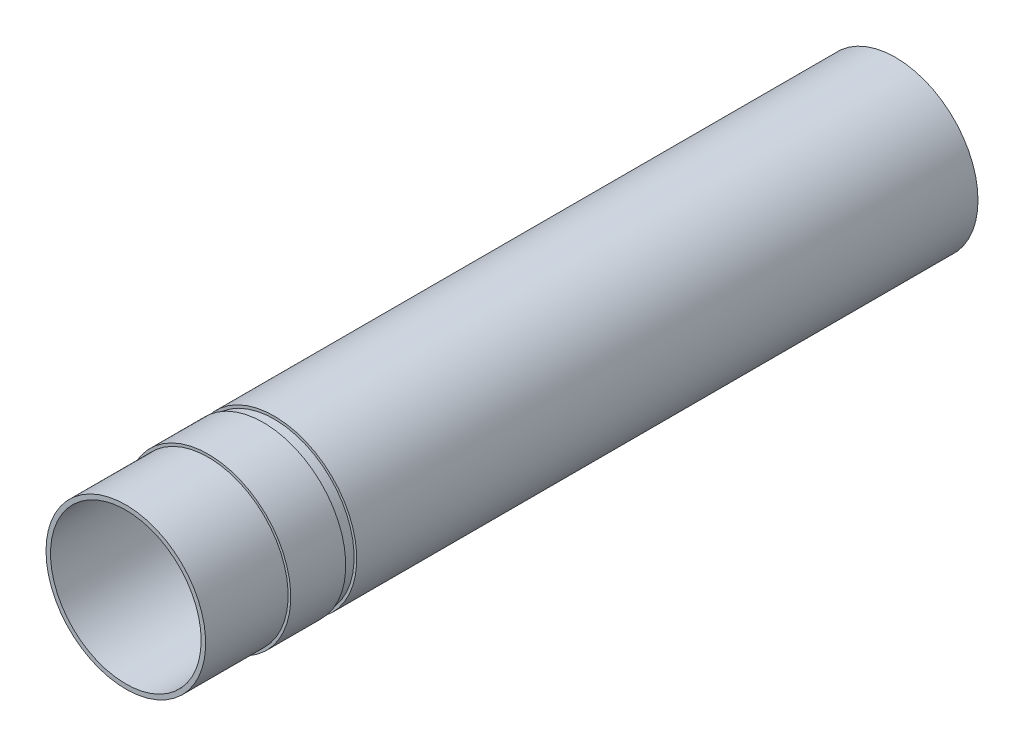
ISO-10303-21;
HEADER;
FILE_DESCRIPTION(('STEP AP214'),'2;1');
FILE_NAME('part.step','',(''),(''),'','','');
FILE_SCHEMA(('AUTOMOTIVE_DESIGN { 1 0 10303 214 1 1 1 1 }'));
ENDSEC;
DATA;
#1=APPLICATION_CONTEXT('core data for automotive mechanical design processes');
#2=APPLICATION_PROTOCOL_DEFINITION('international standard','automotive_design',2000,#1);
#3=PRODUCT_CONTEXT('',#1,'mechanical');
#4=PRODUCT('Part','Part','',(#3));
#5=PRODUCT_RELATED_PRODUCT_CATEGORY('part','',(#4));
#6=PRODUCT_DEFINITION_FORMATION('','',#4);
#7=PRODUCT_DEFINITION_CONTEXT('part definition',#1,'design');
#8=PRODUCT_DEFINITION('design','',#6,#7);
#9=PRODUCT_DEFINITION_SHAPE('','',#8);
#10=(LENGTH_UNIT() NAMED_UNIT(*) SI_UNIT(.MILLI.,.METRE.));
#11=(NAMED_UNIT(*) PLANE_ANGLE_UNIT() SI_UNIT($,.RADIAN.));
#12=(NAMED_UNIT(*) SI_UNIT($,.STERADIAN.) SOLID_ANGLE_UNIT());
#13=UNCERTAINTY_MEASURE_WITH_UNIT(LENGTH_MEASURE(1.E-05),#10,'distance_accuracy_value','');
#14=(GEOMETRIC_REPRESENTATION_CONTEXT(3) GLOBAL_UNCERTAINTY_ASSIGNED_CONTEXT((#13)) GLOBAL_UNIT_ASSIGNED_CONTEXT((#10,
#11,#12)) REPRESENTATION_CONTEXT('',''));
#15=CARTESIAN_POINT('',(0.,0.,0.));
#16=DIRECTION('',(0.,0.,1.));
#17=DIRECTION('',(1.,0.,0.));
#18=AXIS2_PLACEMENT_3D('',#15,#16,#17);
#19=CARTESIAN_POINT('',(0.,0.,88.9));
#20=DIRECTION('',(0.,0.,-1.));
#21=DIRECTION('',(-1.,0.,0.));
#22=AXIS2_PLACEMENT_3D('',#19,#20,#21);
#23=CYLINDRICAL_SURFACE('',#22,19.05);
#24=CARTESIAN_POINT('',(0.,0.,54.61));
#25=DIRECTION('',(0.,0.,-1.));
#26=DIRECTION('',(-1.,0.,0.));
#27=AXIS2_PLACEMENT_3D('',#24,#25,#26);
#28=CIRCLE('',#27,19.05);
#29=CARTESIAN_POINT('',(-19.05,0.,54.61));
#30=VERTEX_POINT('',#29);
#31=EDGE_CURVE('E112',#30,#30,#28,.T.);
#32=ORIENTED_EDGE('',*,*,#31,.T.);
#33=EDGE_LOOP('',(#32));
#34=FACE_BOUND('',#33,.T.);
#35=CARTESIAN_POINT('',(0.,0.,-88.9));
#36=DIRECTION('',(0.,0.,1.));
#37=DIRECTION('',(1.,0.,0.));
#38=AXIS2_PLACEMENT_3D('',#35,#36,#37);
#39=CIRCLE('',#38,19.05);
#40=CARTESIAN_POINT('',(19.05,0.,-88.9));
#41=VERTEX_POINT('',#40);
#42=EDGE_CURVE('E40',#41,#41,#39,.T.);
#43=ORIENTED_EDGE('',*,*,#42,.T.);
#44=EDGE_LOOP('',(#43));
#45=FACE_BOUND('',#44,.T.);
#46=ADVANCED_FACE('F32',(#34,#45),#23,.T.);
#47=CARTESIAN_POINT('',(0.,0.,88.9));
#48=DIRECTION('',(0.,0.,-1.));
#49=DIRECTION('',(-1.,0.,0.));
#50=AXIS2_PLACEMENT_3D('',#47,#48,#49);
#51=CYLINDRICAL_SURFACE('',#50,17.399);
#52=CARTESIAN_POINT('',(0.,0.,-50.8));
#53=DIRECTION('',(0.,0.,-1.));
#54=DIRECTION('',(-1.,0.,0.));
#55=AXIS2_PLACEMENT_3D('',#52,#53,#54);
#56=CIRCLE('',#55,17.399);
#57=CARTESIAN_POINT('',(-17.399,0.,-50.8));
#58=VERTEX_POINT('',#57);
#59=EDGE_CURVE('E48',#58,#58,#56,.T.);
#60=ORIENTED_EDGE('',*,*,#59,.F.);
#61=EDGE_LOOP('',(#60));
#62=FACE_BOUND('',#61,.T.);
#63=CARTESIAN_POINT('',(0.,0.,-88.9));
#64=DIRECTION('',(0.,0.,1.));
#65=DIRECTION('',(1.,0.,0.));
#66=AXIS2_PLACEMENT_3D('',#63,#64,#65);
#67=CIRCLE('',#66,17.399);
#68=CARTESIAN_POINT('',(17.399,0.,-88.9));
#69=VERTEX_POINT('',#68);
#70=EDGE_CURVE('E45',#69,#69,#67,.T.);
#71=ORIENTED_EDGE('',*,*,#70,.F.);
#72=EDGE_LOOP('',(#71));
#73=FACE_BOUND('',#72,.T.);
#74=ADVANCED_FACE('F69',(#62,#73),#51,.F.);
#75=CARTESIAN_POINT('',(0.,0.,-88.9));
#76=DIRECTION('',(0.,0.,1.));
#77=DIRECTION('',(1.,0.,0.));
#78=AXIS2_PLACEMENT_3D('',#75,#76,#77);
#79=PLANE('',#78);
#80=ORIENTED_EDGE('',*,*,#70,.T.);
#81=EDGE_LOOP('',(#80));
#82=FACE_BOUND('',#81,.T.);
#83=ORIENTED_EDGE('',*,*,#42,.F.);
#84=EDGE_LOOP('',(#83));
#85=FACE_BOUND('',#84,.T.);
#86=ADVANCED_FACE('F66',(#82,#85),#79,.F.);
#87=CARTESIAN_POINT('',(0.,0.,-48.26));
#88=DIRECTION('',(0.,0.,1.));
#89=DIRECTION('',(1.,0.,0.));
#90=AXIS2_PLACEMENT_3D('',#87,#88,#89);
#91=PLANE('',#90);
#92=CARTESIAN_POINT('',(0.,0.,-48.26));
#93=DIRECTION('',(0.,0.,1.));
#94=DIRECTION('',(1.,0.,0.));
#95=AXIS2_PLACEMENT_3D('',#92,#93,#94);
#96=CIRCLE('',#95,17.399);
#97=CARTESIAN_POINT('',(17.399,0.,-48.26));
#98=VERTEX_POINT('',#97);
#99=EDGE_CURVE('E36',#98,#98,#96,.T.);
#100=ORIENTED_EDGE('',*,*,#99,.T.);
#101=EDGE_LOOP('',(#100));
#102=FACE_BOUND('',#101,.T.);
#103=CARTESIAN_POINT('',(0.,0.,-48.26));
#104=DIRECTION('',(0.,0.,-1.));
#105=DIRECTION('',(-1.,0.,0.));
#106=AXIS2_PLACEMENT_3D('',#103,#104,#105);
#107=CIRCLE('',#106,18.2626);
#108=CARTESIAN_POINT('',(-18.2626,0.,-48.26));
#109=VERTEX_POINT('',#108);
#110=EDGE_CURVE('E100',#109,#109,#107,.T.);
#111=ORIENTED_EDGE('',*,*,#110,.T.);
#112=EDGE_LOOP('',(#111));
#113=FACE_BOUND('',#112,.T.);
#114=ADVANCED_FACE('F78',(#102,#113),#91,.F.);
#115=CARTESIAN_POINT('',(0.,0.,0.));
#116=DIRECTION('',(0.,0.,-1.));
#117=DIRECTION('',(-1.,0.,0.));
#118=AXIS2_PLACEMENT_3D('',#115,#116,#117);
#119=CYLINDRICAL_SURFACE('',#118,18.2626);
#120=ORIENTED_EDGE('',*,*,#110,.F.);
#121=EDGE_LOOP('',(#120));
#122=FACE_BOUND('',#121,.T.);
#123=CARTESIAN_POINT('',(0.,0.,-50.8));
#124=DIRECTION('',(0.,0.,-1.));
#125=DIRECTION('',(-1.,0.,0.));
#126=AXIS2_PLACEMENT_3D('',#123,#124,#125);
#127=CIRCLE('',#126,18.2626);
#128=CARTESIAN_POINT('',(-18.2626,0.,-50.8));
#129=VERTEX_POINT('',#128);
#130=EDGE_CURVE('E103',#129,#129,#127,.T.);
#131=ORIENTED_EDGE('',*,*,#130,.T.);
#132=EDGE_LOOP('',(#131));
#133=FACE_BOUND('',#132,.T.);
#134=ADVANCED_FACE('F91',(#122,#133),#119,.F.);
#135=CARTESIAN_POINT('',(0.,0.,-50.8));
#136=DIRECTION('',(0.,0.,-1.));
#137=DIRECTION('',(-1.,0.,0.));
#138=AXIS2_PLACEMENT_3D('',#135,#136,#137);
#139=PLANE('',#138);
#140=ORIENTED_EDGE('',*,*,#59,.T.);
#141=EDGE_LOOP('',(#140));
#142=FACE_BOUND('',#141,.T.);
#143=ORIENTED_EDGE('',*,*,#130,.F.);
#144=EDGE_LOOP('',(#143));
#145=FACE_BOUND('',#144,.T.);
#146=ADVANCED_FACE('F83',(#142,#145),#139,.F.);
#147=ORIENTED_EDGE('',*,*,#99,.F.);
#148=EDGE_LOOP('',(#147));
#149=FACE_BOUND('',#148,.T.);
#150=CARTESIAN_POINT('',(0.,0.,88.9));
#151=DIRECTION('',(0.,0.,1.));
#152=DIRECTION('',(1.,0.,0.));
#153=AXIS2_PLACEMENT_3D('',#150,#151,#152);
#154=CIRCLE('',#153,17.399);
#155=CARTESIAN_POINT('',(17.399,0.,88.9));
#156=VERTEX_POINT('',#155);
#157=EDGE_CURVE('E10',#156,#156,#154,.T.);
#158=ORIENTED_EDGE('',*,*,#157,.T.);
#159=EDGE_LOOP('',(#158));
#160=FACE_BOUND('',#159,.T.);
#161=ADVANCED_FACE('F73',(#149,#160),#51,.F.);
#162=CARTESIAN_POINT('',(0.,0.,88.9));
#163=DIRECTION('',(0.,0.,1.));
#164=DIRECTION('',(1.,0.,0.));
#165=AXIS2_PLACEMENT_3D('',#162,#163,#164);
#166=PLANE('',#165);
#167=CARTESIAN_POINT('',(0.,0.,88.9));
#168=DIRECTION('',(0.,0.,-1.));
#169=DIRECTION('',(-1.,0.,0.));
#170=AXIS2_PLACEMENT_3D('',#167,#168,#169);
#171=CIRCLE('',#170,18.4404);
#172=CARTESIAN_POINT('',(-18.4404,0.,88.9));
#173=VERTEX_POINT('',#172);
#174=EDGE_CURVE('E114',#173,#173,#171,.T.);
#175=ORIENTED_EDGE('',*,*,#174,.F.);
#176=EDGE_LOOP('',(#175));
#177=FACE_BOUND('',#176,.T.);
#178=ORIENTED_EDGE('',*,*,#157,.F.);
#179=EDGE_LOOP('',(#178));
#180=FACE_BOUND('',#179,.T.);
#181=ADVANCED_FACE('F82',(#177,#180),#166,.T.);
#182=CARTESIAN_POINT('',(0.,19.05,54.61));
#183=DIRECTION('',(0.,0.,-1.));
#184=DIRECTION('',(-1.,0.,0.));
#185=AXIS2_PLACEMENT_3D('',#182,#183,#184);
#186=PLANE('',#185);
#187=ORIENTED_EDGE('',*,*,#31,.F.);
#188=EDGE_LOOP('',(#187));
#189=FACE_BOUND('',#188,.T.);
#190=CARTESIAN_POINT('',(0.,0.,54.61));
#191=DIRECTION('',(0.,0.,-1.));
#192=DIRECTION('',(-1.,0.,0.));
#193=AXIS2_PLACEMENT_3D('',#190,#191,#192);
#194=CIRCLE('',#193,18.4404);
#195=CARTESIAN_POINT('',(-18.4404,0.,54.61));
#196=VERTEX_POINT('',#195);
#197=EDGE_CURVE('E50',#196,#196,#194,.T.);
#198=ORIENTED_EDGE('',*,*,#197,.T.);
#199=EDGE_LOOP('',(#198));
#200=FACE_BOUND('',#199,.T.);
#201=ADVANCED_FACE('F89',(#189,#200),#186,.F.);
#202=CARTESIAN_POINT('',(0.,0.,0.));
#203=DIRECTION('',(0.,0.,-1.));
#204=DIRECTION('',(-1.,0.,0.));
#205=AXIS2_PLACEMENT_3D('',#202,#203,#204);
#206=CYLINDRICAL_SURFACE('',#205,18.4404);
#207=ORIENTED_EDGE('',*,*,#197,.F.);
#208=EDGE_LOOP('',(#207));
#209=FACE_BOUND('',#208,.T.);
#210=CARTESIAN_POINT('',(0.,0.,57.15));
#211=DIRECTION('',(0.,0.,-1.));
#212=DIRECTION('',(-1.,0.,0.));
#213=AXIS2_PLACEMENT_3D('',#210,#211,#212);
#214=CIRCLE('',#213,18.4404);
#215=CARTESIAN_POINT('',(-18.4404,0.,57.15));
#216=VERTEX_POINT('',#215);
#217=EDGE_CURVE('E55',#216,#216,#214,.T.);
#218=ORIENTED_EDGE('',*,*,#217,.T.);
#219=EDGE_LOOP('',(#218));
#220=FACE_BOUND('',#219,.T.);
#221=ADVANCED_FACE('F144',(#209,#220),#206,.T.);
#222=CARTESIAN_POINT('',(0.,19.05,57.15));
#223=DIRECTION('',(0.,0.,1.));
#224=DIRECTION('',(1.,0.,0.));
#225=AXIS2_PLACEMENT_3D('',#222,#223,#224);
#226=PLANE('',#225);
#227=ORIENTED_EDGE('',*,*,#217,.F.);
#228=EDGE_LOOP('',(#227));
#229=FACE_BOUND('',#228,.T.);
#230=CARTESIAN_POINT('',(0.,0.,57.15));
#231=DIRECTION('',(0.,0.,-1.));
#232=DIRECTION('',(-1.,0.,0.));
#233=AXIS2_PLACEMENT_3D('',#230,#231,#232);
#234=CIRCLE('',#233,19.05);
#235=CARTESIAN_POINT('',(-19.05,0.,57.15));
#236=VERTEX_POINT('',#235);
#237=EDGE_CURVE('E60',#236,#236,#234,.T.);
#238=ORIENTED_EDGE('',*,*,#237,.T.);
#239=EDGE_LOOP('',(#238));
#240=FACE_BOUND('',#239,.T.);
#241=ADVANCED_FACE('F118',(#229,#240),#226,.F.);
#242=CARTESIAN_POINT('',(0.,0.,0.));
#243=DIRECTION('',(0.,0.,-1.));
#244=DIRECTION('',(-1.,0.,0.));
#245=AXIS2_PLACEMENT_3D('',#242,#243,#244);
#246=CYLINDRICAL_SURFACE('',#245,18.4404);
#247=CARTESIAN_POINT('',(0.,0.,69.85));
#248=DIRECTION('',(0.,0.,-1.));
#249=DIRECTION('',(-1.,0.,0.));
#250=AXIS2_PLACEMENT_3D('',#247,#248,#249);
#251=CIRCLE('',#250,18.4404);
#252=CARTESIAN_POINT('',(-18.4404,0.,69.85));
#253=VERTEX_POINT('',#252);
#254=EDGE_CURVE('E106',#253,#253,#251,.T.);
#255=ORIENTED_EDGE('',*,*,#254,.F.);
#256=EDGE_LOOP('',(#255));
#257=FACE_BOUND('',#256,.T.);
#258=ORIENTED_EDGE('',*,*,#174,.T.);
#259=EDGE_LOOP('',(#258));
#260=FACE_BOUND('',#259,.T.);
#261=ADVANCED_FACE('F126',(#257,#260),#246,.T.);
#262=CARTESIAN_POINT('',(0.,19.05,69.85));
#263=DIRECTION('',(0.,0.,-1.));
#264=DIRECTION('',(-1.,0.,0.));
#265=AXIS2_PLACEMENT_3D('',#262,#263,#264);
#266=PLANE('',#265);
#267=CARTESIAN_POINT('',(0.,0.,69.85));
#268=DIRECTION('',(0.,0.,-1.));
#269=DIRECTION('',(-1.,0.,0.));
#270=AXIS2_PLACEMENT_3D('',#267,#268,#269);
#271=CIRCLE('',#270,19.05);
#272=CARTESIAN_POINT('',(-19.05,0.,69.85));
#273=VERTEX_POINT('',#272);
#274=EDGE_CURVE('E102',#273,#273,#271,.T.);
#275=ORIENTED_EDGE('',*,*,#274,.F.);
#276=EDGE_LOOP('',(#275));
#277=FACE_BOUND('',#276,.T.);
#278=ORIENTED_EDGE('',*,*,#254,.T.);
#279=EDGE_LOOP('',(#278));
#280=FACE_BOUND('',#279,.T.);
#281=ADVANCED_FACE('F121',(#277,#280),#266,.F.);
#282=ORIENTED_EDGE('',*,*,#274,.T.);
#283=EDGE_LOOP('',(#282));
#284=FACE_BOUND('',#283,.T.);
#285=ORIENTED_EDGE('',*,*,#237,.F.);
#286=EDGE_LOOP('',(#285));
#287=FACE_BOUND('',#286,.T.);
#288=ADVANCED_FACE('F34',(#284,#287),#23,.T.);
#289=CLOSED_SHELL('',(#46,#74,#86,#114,#134,#146,#161,#181,#201,#221,#241,#261,#281,#288));
#290=MANIFOLD_SOLID_BREP('B2',#289);
#291=ADVANCED_BREP_SHAPE_REPRESENTATION('',(#18,#290),#14);
#292=SHAPE_DEFINITION_REPRESENTATION(#9,#291);
ENDSEC;
END-ISO-10303-21;
